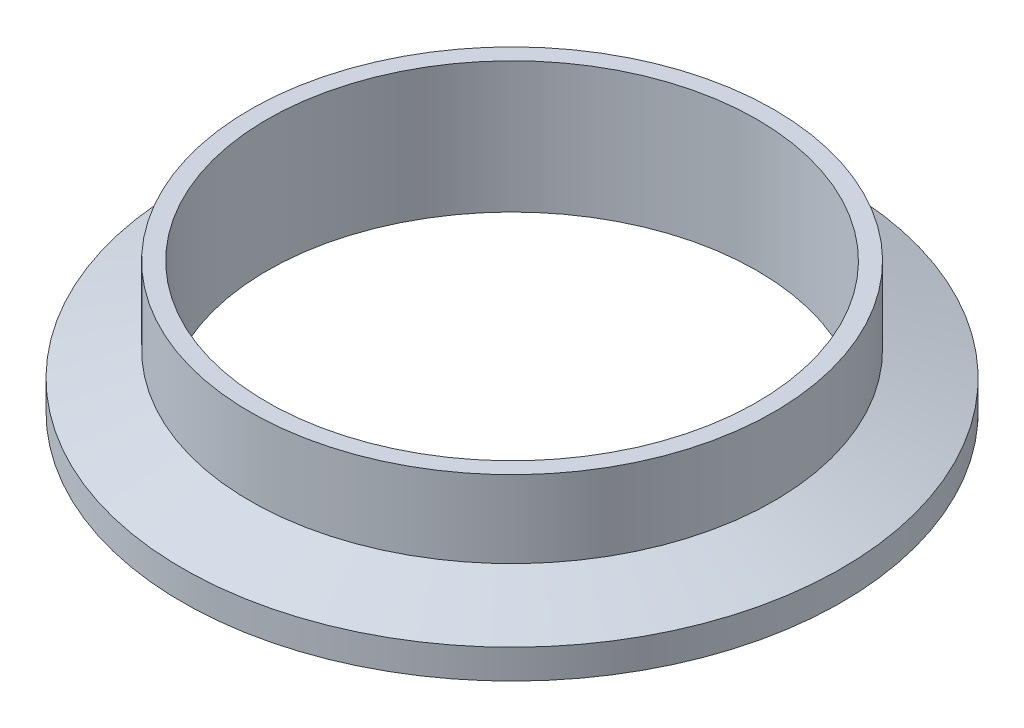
from build123d import *


with BuildPart() as part:
    # Sketch1 → Revolve2 (revolve)
    with BuildSketch(Plane.XY, mode=Mode.PRIVATE) as revolve2_sk:
        with BuildLine():
            Line((-23.749, 0), (-23.749, 12.7))
            Line((-23.749, 12.7), (-25.4, 12.7))
            Line((-25.4, 12.7), (-25.4, 5.229969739))
            Line((-25.4, 5.229969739), (-31.9532, 2.8448))
            Line((-31.9532, 2.8448), (-31.9532, 0))
            Line((-31.9532, 0), (-30.159172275, 0))
            ThreePointArc((-30.159172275, 0), (-29.724577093, 0.130798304), (-29.434366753, 0.479738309))
            Line((-29.434366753, 0.479738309), (-29.267498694, 0.872854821))
            ThreePointArc((-29.267498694, 0.872854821), (-28.1686, 1.6002), (-27.069701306, 0.872854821))
            Line((-27.069701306, 0.872854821), (-26.902833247, 0.479738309))
            ThreePointArc((-26.902833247, 0.479738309), (-26.612622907, 0.130798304), (-26.178027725, 0))
            Line((-26.178027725, 0), (-23.749, 0))
        make_face()
    revolve(revolve2_sk.sketch.rotate(Axis((0, 0, 0), (0, 1, 0)), 270), axis=Axis((0, 0, 0), (0, 1, 0)))


solid = part.part
